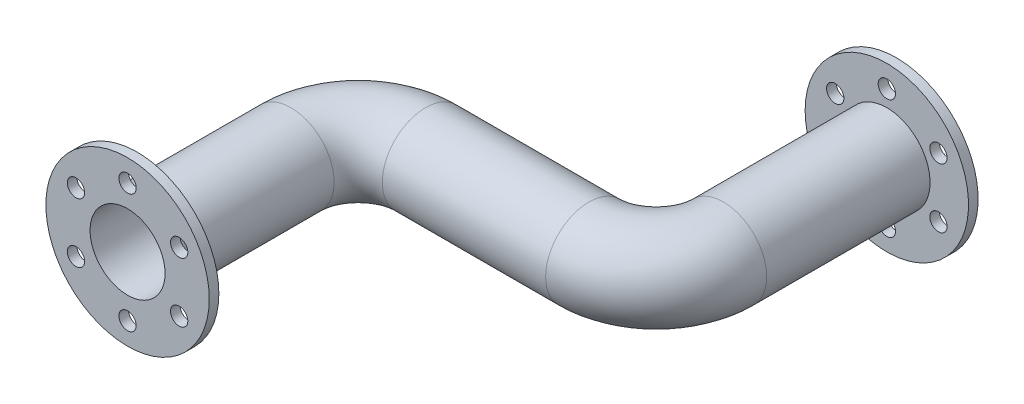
ISO-10303-21;
HEADER;
FILE_DESCRIPTION(('STEP AP214'),'2;1');
FILE_NAME('part.step','',(''),(''),'','','');
FILE_SCHEMA(('AUTOMOTIVE_DESIGN { 1 0 10303 214 1 1 1 1 }'));
ENDSEC;
DATA;
#1=APPLICATION_CONTEXT('core data for automotive mechanical design processes');
#2=APPLICATION_PROTOCOL_DEFINITION('international standard','automotive_design',2000,#1);
#3=PRODUCT_CONTEXT('',#1,'mechanical');
#4=PRODUCT('Part','Part','',(#3));
#5=PRODUCT_RELATED_PRODUCT_CATEGORY('part','',(#4));
#6=PRODUCT_DEFINITION_FORMATION('','',#4);
#7=PRODUCT_DEFINITION_CONTEXT('part definition',#1,'design');
#8=PRODUCT_DEFINITION('design','',#6,#7);
#9=PRODUCT_DEFINITION_SHAPE('','',#8);
#10=(LENGTH_UNIT() NAMED_UNIT(*) SI_UNIT(.MILLI.,.METRE.));
#11=(NAMED_UNIT(*) PLANE_ANGLE_UNIT() SI_UNIT($,.RADIAN.));
#12=(NAMED_UNIT(*) SI_UNIT($,.STERADIAN.) SOLID_ANGLE_UNIT());
#13=UNCERTAINTY_MEASURE_WITH_UNIT(LENGTH_MEASURE(1.E-05),#10,'distance_accuracy_value','');
#14=(GEOMETRIC_REPRESENTATION_CONTEXT(3) GLOBAL_UNCERTAINTY_ASSIGNED_CONTEXT((#13)) GLOBAL_UNIT_ASSIGNED_CONTEXT((#10,
#11,#12)) REPRESENTATION_CONTEXT('',''));
#15=CARTESIAN_POINT('',(0.,0.,0.));
#16=DIRECTION('',(0.,0.,1.));
#17=DIRECTION('',(1.,0.,0.));
#18=AXIS2_PLACEMENT_3D('',#15,#16,#17);
#19=CARTESIAN_POINT('',(0.,0.,-85.));
#20=DIRECTION('',(0.,0.,1.));
#21=DIRECTION('',(1.,0.,0.));
#22=AXIS2_PLACEMENT_3D('',#19,#20,#21);
#23=CYLINDRICAL_SURFACE('',#22,22.5);
#24=CARTESIAN_POINT('',(0.,0.,-85.));
#25=DIRECTION('',(0.,0.,1.));
#26=DIRECTION('',(1.,0.,0.));
#27=AXIS2_PLACEMENT_3D('',#24,#25,#26);
#28=CIRCLE('',#27,22.5);
#29=CARTESIAN_POINT('',(-22.5,0.,-85.));
#30=VERTEX_POINT('',#29);
#31=EDGE_CURVE('E57',#30,#30,#28,.T.);
#32=ORIENTED_EDGE('',*,*,#31,.T.);
#33=EDGE_LOOP('',(#32));
#34=FACE_BOUND('',#33,.T.);
#35=CARTESIAN_POINT('',(0.,0.,-5.));
#36=DIRECTION('',(0.,0.,1.));
#37=DIRECTION('',(1.,0.,0.));
#38=AXIS2_PLACEMENT_3D('',#35,#36,#37);
#39=CIRCLE('',#38,22.5);
#40=CARTESIAN_POINT('',(22.5,0.,-5.));
#41=VERTEX_POINT('',#40);
#42=EDGE_CURVE('E35',#41,#41,#39,.F.);
#43=ORIENTED_EDGE('',*,*,#42,.T.);
#44=EDGE_LOOP('',(#43));
#45=FACE_BOUND('',#44,.T.);
#46=ADVANCED_FACE('F31',(#34,#45),#23,.T.);
#47=CARTESIAN_POINT('',(155.,0.,-155.));
#48=DIRECTION('',(0.,0.,-1.));
#49=DIRECTION('',(-1.,0.,0.));
#50=AXIS2_PLACEMENT_3D('',#47,#48,#49);
#51=CYLINDRICAL_SURFACE('',#50,22.5);
#52=CARTESIAN_POINT('',(155.,0.,-155.));
#53=DIRECTION('',(0.,0.,1.));
#54=DIRECTION('',(1.,0.,0.));
#55=AXIS2_PLACEMENT_3D('',#52,#53,#54);
#56=CIRCLE('',#55,22.5);
#57=CARTESIAN_POINT('',(177.5,0.,-155.));
#58=VERTEX_POINT('',#57);
#59=EDGE_CURVE('E10',#58,#58,#56,.T.);
#60=ORIENTED_EDGE('',*,*,#59,.F.);
#61=EDGE_LOOP('',(#60));
#62=FACE_BOUND('',#61,.T.);
#63=CARTESIAN_POINT('',(155.,0.,-240.));
#64=DIRECTION('',(0.,0.,-1.));
#65=DIRECTION('',(-1.,0.,0.));
#66=AXIS2_PLACEMENT_3D('',#63,#64,#65);
#67=CIRCLE('',#66,22.5);
#68=CARTESIAN_POINT('',(132.5,0.,-240.));
#69=VERTEX_POINT('',#68);
#70=EDGE_CURVE('E108',#69,#69,#67,.T.);
#71=ORIENTED_EDGE('',*,*,#70,.F.);
#72=EDGE_LOOP('',(#71));
#73=FACE_BOUND('',#72,.T.);
#74=ADVANCED_FACE('F33',(#62,#73),#51,.T.);
#75=CARTESIAN_POINT('',(155.,0.,-155.));
#76=DIRECTION('',(0.,0.,-1.));
#77=DIRECTION('',(-1.,0.,0.));
#78=AXIS2_PLACEMENT_3D('',#75,#76,#77);
#79=CYLINDRICAL_SURFACE('',#78,19.5);
#80=CARTESIAN_POINT('',(155.,0.,-155.));
#81=DIRECTION('',(0.,0.,1.));
#82=DIRECTION('',(1.,0.,0.));
#83=AXIS2_PLACEMENT_3D('',#80,#81,#82);
#84=CIRCLE('',#83,19.5);
#85=CARTESIAN_POINT('',(174.5,0.,-155.));
#86=VERTEX_POINT('',#85);
#87=EDGE_CURVE('E39',#86,#86,#84,.T.);
#88=ORIENTED_EDGE('',*,*,#87,.T.);
#89=EDGE_LOOP('',(#88));
#90=FACE_BOUND('',#89,.T.);
#91=CARTESIAN_POINT('',(155.,0.,-245.));
#92=DIRECTION('',(0.,0.,-1.));
#93=DIRECTION('',(-1.,0.,0.));
#94=AXIS2_PLACEMENT_3D('',#91,#92,#93);
#95=CIRCLE('',#94,19.5);
#96=CARTESIAN_POINT('',(135.5,0.,-245.));
#97=VERTEX_POINT('',#96);
#98=EDGE_CURVE('E117',#97,#97,#95,.T.);
#99=ORIENTED_EDGE('',*,*,#98,.T.);
#100=EDGE_LOOP('',(#99));
#101=FACE_BOUND('',#100,.T.);
#102=ADVANCED_FACE('F180',(#90,#101),#79,.F.);
#103=CARTESIAN_POINT('',(120.,0.,-155.));
#104=DIRECTION('',(0.,1.,0.));
#105=DIRECTION('',(0.,0.,1.));
#106=AXIS2_PLACEMENT_3D('',#103,#104,#105);
#107=TOROIDAL_SURFACE('',#106,35.,22.5);
#108=CARTESIAN_POINT('',(120.,0.,-120.));
#109=DIRECTION('',(-1.,0.,0.));
#110=DIRECTION('',(0.,0.,1.));
#111=AXIS2_PLACEMENT_3D('',#108,#109,#110);
#112=CIRCLE('',#111,22.5);
#113=CARTESIAN_POINT('',(120.,0.,-97.5));
#114=VERTEX_POINT('',#113);
#115=EDGE_CURVE('E43',#114,#114,#112,.T.);
#116=CARTESIAN_POINT('',(120.,0.,-155.));
#117=DIRECTION('',(0.,1.,0.));
#118=DIRECTION('',(0.,0.,1.));
#119=AXIS2_PLACEMENT_3D('',#116,#117,#118);
#120=CIRCLE('',#119,57.5);
#121=EDGE_CURVE('',#114,#58,#120,.T.);
#122=ORIENTED_EDGE('',*,*,#115,.F.);
#123=ORIENTED_EDGE('',*,*,#59,.T.);
#124=ORIENTED_EDGE('',*,*,#121,.T.);
#125=ORIENTED_EDGE('',*,*,#121,.F.);
#126=EDGE_LOOP('',(#122,#124,#123,#125));
#127=FACE_BOUND('',#126,.T.);
#128=ADVANCED_FACE('F182',(#127),#107,.T.);
#129=CARTESIAN_POINT('',(120.,0.,-155.));
#130=DIRECTION('',(0.,1.,0.));
#131=DIRECTION('',(0.,0.,1.));
#132=AXIS2_PLACEMENT_3D('',#129,#130,#131);
#133=TOROIDAL_SURFACE('',#132,35.,19.5);
#134=CARTESIAN_POINT('',(120.,0.,-120.));
#135=DIRECTION('',(-1.,0.,0.));
#136=DIRECTION('',(0.,0.,1.));
#137=AXIS2_PLACEMENT_3D('',#134,#135,#136);
#138=CIRCLE('',#137,19.5);
#139=CARTESIAN_POINT('',(120.,0.,-100.5));
#140=VERTEX_POINT('',#139);
#141=EDGE_CURVE('E48',#140,#140,#138,.T.);
#142=CARTESIAN_POINT('',(120.,0.,-155.));
#143=DIRECTION('',(0.,1.,0.));
#144=DIRECTION('',(0.,0.,1.));
#145=AXIS2_PLACEMENT_3D('',#142,#143,#144);
#146=CIRCLE('',#145,54.5);
#147=EDGE_CURVE('',#140,#86,#146,.T.);
#148=ORIENTED_EDGE('',*,*,#141,.T.);
#149=ORIENTED_EDGE('',*,*,#87,.F.);
#150=ORIENTED_EDGE('',*,*,#147,.T.);
#151=ORIENTED_EDGE('',*,*,#147,.F.);
#152=EDGE_LOOP('',(#148,#150,#149,#151));
#153=FACE_BOUND('',#152,.T.);
#154=ADVANCED_FACE('F188',(#153),#133,.F.);
#155=CARTESIAN_POINT('',(35.,0.,-120.));
#156=DIRECTION('',(1.,0.,0.));
#157=DIRECTION('',(0.,0.,-1.));
#158=AXIS2_PLACEMENT_3D('',#155,#156,#157);
#159=CYLINDRICAL_SURFACE('',#158,22.5);
#160=CARTESIAN_POINT('',(35.,0.,-120.));
#161=DIRECTION('',(-1.,0.,0.));
#162=DIRECTION('',(0.,0.,1.));
#163=AXIS2_PLACEMENT_3D('',#160,#161,#162);
#164=CIRCLE('',#163,22.5);
#165=CARTESIAN_POINT('',(35.,0.,-142.5));
#166=VERTEX_POINT('',#165);
#167=EDGE_CURVE('E51',#166,#166,#164,.T.);
#168=ORIENTED_EDGE('',*,*,#167,.F.);
#169=EDGE_LOOP('',(#168));
#170=FACE_BOUND('',#169,.T.);
#171=ORIENTED_EDGE('',*,*,#115,.T.);
#172=EDGE_LOOP('',(#171));
#173=FACE_BOUND('',#172,.T.);
#174=ADVANCED_FACE('F217',(#170,#173),#159,.T.);
#175=CARTESIAN_POINT('',(35.,0.,-120.));
#176=DIRECTION('',(1.,0.,0.));
#177=DIRECTION('',(0.,0.,-1.));
#178=AXIS2_PLACEMENT_3D('',#175,#176,#177);
#179=CYLINDRICAL_SURFACE('',#178,19.5);
#180=CARTESIAN_POINT('',(35.,0.,-120.));
#181=DIRECTION('',(-1.,0.,0.));
#182=DIRECTION('',(0.,0.,1.));
#183=AXIS2_PLACEMENT_3D('',#180,#181,#182);
#184=CIRCLE('',#183,19.5);
#185=CARTESIAN_POINT('',(35.,0.,-139.5));
#186=VERTEX_POINT('',#185);
#187=EDGE_CURVE('E54',#186,#186,#184,.T.);
#188=ORIENTED_EDGE('',*,*,#187,.T.);
#189=EDGE_LOOP('',(#188));
#190=FACE_BOUND('',#189,.T.);
#191=ORIENTED_EDGE('',*,*,#141,.F.);
#192=EDGE_LOOP('',(#191));
#193=FACE_BOUND('',#192,.T.);
#194=ADVANCED_FACE('F213',(#190,#193),#179,.F.);
#195=CARTESIAN_POINT('',(35.,0.,-85.));
#196=DIRECTION('',(0.,-1.,0.));
#197=DIRECTION('',(0.,0.,-1.));
#198=AXIS2_PLACEMENT_3D('',#195,#196,#197);
#199=TOROIDAL_SURFACE('',#198,35.,22.5);
#200=CARTESIAN_POINT('',(35.,0.,-85.));
#201=DIRECTION('',(0.,-1.,0.));
#202=DIRECTION('',(0.,0.,-1.));
#203=AXIS2_PLACEMENT_3D('',#200,#201,#202);
#204=CIRCLE('',#203,57.5);
#205=EDGE_CURVE('',#30,#166,#204,.T.);
#206=ORIENTED_EDGE('',*,*,#31,.F.);
#207=ORIENTED_EDGE('',*,*,#167,.T.);
#208=ORIENTED_EDGE('',*,*,#205,.T.);
#209=ORIENTED_EDGE('',*,*,#205,.F.);
#210=EDGE_LOOP('',(#206,#208,#207,#209));
#211=FACE_BOUND('',#210,.T.);
#212=ADVANCED_FACE('F209',(#211),#199,.T.);
#213=CARTESIAN_POINT('',(35.,0.,-85.));
#214=DIRECTION('',(0.,-1.,0.));
#215=DIRECTION('',(0.,0.,-1.));
#216=AXIS2_PLACEMENT_3D('',#213,#214,#215);
#217=TOROIDAL_SURFACE('',#216,35.,19.5);
#218=CARTESIAN_POINT('',(0.,0.,-85.));
#219=DIRECTION('',(0.,0.,1.));
#220=DIRECTION('',(1.,0.,0.));
#221=AXIS2_PLACEMENT_3D('',#218,#219,#220);
#222=CIRCLE('',#221,19.5);
#223=CARTESIAN_POINT('',(-19.5,0.,-85.));
#224=VERTEX_POINT('',#223);
#225=EDGE_CURVE('E60',#224,#224,#222,.T.);
#226=CARTESIAN_POINT('',(35.,0.,-85.));
#227=DIRECTION('',(0.,-1.,0.));
#228=DIRECTION('',(0.,0.,-1.));
#229=AXIS2_PLACEMENT_3D('',#226,#227,#228);
#230=CIRCLE('',#229,54.5);
#231=EDGE_CURVE('',#224,#186,#230,.T.);
#232=ORIENTED_EDGE('',*,*,#225,.T.);
#233=ORIENTED_EDGE('',*,*,#187,.F.);
#234=ORIENTED_EDGE('',*,*,#231,.T.);
#235=ORIENTED_EDGE('',*,*,#231,.F.);
#236=EDGE_LOOP('',(#232,#234,#233,#235));
#237=FACE_BOUND('',#236,.T.);
#238=ADVANCED_FACE('F205',(#237),#217,.F.);
#239=CARTESIAN_POINT('',(0.,0.,-85.));
#240=DIRECTION('',(0.,0.,1.));
#241=DIRECTION('',(1.,0.,0.));
#242=AXIS2_PLACEMENT_3D('',#239,#240,#241);
#243=CYLINDRICAL_SURFACE('',#242,19.5);
#244=CARTESIAN_POINT('',(0.,0.,0.));
#245=DIRECTION('',(0.,0.,1.));
#246=DIRECTION('',(1.,0.,0.));
#247=AXIS2_PLACEMENT_3D('',#244,#245,#246);
#248=CIRCLE('',#247,19.5);
#249=CARTESIAN_POINT('',(19.5,0.,0.));
#250=VERTEX_POINT('',#249);
#251=EDGE_CURVE('E63',#250,#250,#248,.T.);
#252=ORIENTED_EDGE('',*,*,#251,.T.);
#253=EDGE_LOOP('',(#252));
#254=FACE_BOUND('',#253,.T.);
#255=ORIENTED_EDGE('',*,*,#225,.F.);
#256=EDGE_LOOP('',(#255));
#257=FACE_BOUND('',#256,.T.);
#258=ADVANCED_FACE('F202',(#254,#257),#243,.F.);
#259=CARTESIAN_POINT('',(0.,0.,0.));
#260=DIRECTION('',(0.,0.,1.));
#261=DIRECTION('',(1.,0.,0.));
#262=AXIS2_PLACEMENT_3D('',#259,#260,#261);
#263=PLANE('',#262);
#264=CARTESIAN_POINT('',(-26.8467875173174,-15.5000000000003,0.));
#265=DIRECTION('',(0.,0.,1.));
#266=DIRECTION('',(0.50000000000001,-0.866025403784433,0.));
#267=AXIS2_PLACEMENT_3D('',#264,#265,#266);
#268=CIRCLE('',#267,4.5);
#269=CARTESIAN_POINT('',(-24.5967875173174,-19.3971143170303,0.));
#270=VERTEX_POINT('',#269);
#271=EDGE_CURVE('E102',#270,#270,#268,.T.);
#272=ORIENTED_EDGE('',*,*,#271,.F.);
#273=EDGE_LOOP('',(#272));
#274=FACE_BOUND('',#273,.T.);
#275=CARTESIAN_POINT('',(-26.8467875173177,15.4999999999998,0.));
#276=DIRECTION('',(0.,0.,1.));
#277=DIRECTION('',(-0.499999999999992,-0.866025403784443,0.));
#278=AXIS2_PLACEMENT_3D('',#275,#276,#277);
#279=CIRCLE('',#278,4.5);
#280=CARTESIAN_POINT('',(-29.0967875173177,11.6028856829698,0.));
#281=VERTEX_POINT('',#280);
#282=EDGE_CURVE('E96',#281,#281,#279,.T.);
#283=ORIENTED_EDGE('',*,*,#282,.F.);
#284=EDGE_LOOP('',(#283));
#285=FACE_BOUND('',#284,.T.);
#286=CARTESIAN_POINT('',(-2.16471968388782E-13,31.,0.));
#287=DIRECTION('',(0.,0.,1.));
#288=DIRECTION('',(-1.,0.,0.));
#289=AXIS2_PLACEMENT_3D('',#286,#287,#288);
#290=CIRCLE('',#289,4.5);
#291=CARTESIAN_POINT('',(-4.50000000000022,31.,0.));
#292=VERTEX_POINT('',#291);
#293=EDGE_CURVE('E90',#292,#292,#290,.T.);
#294=ORIENTED_EDGE('',*,*,#293,.F.);
#295=EDGE_LOOP('',(#294));
#296=FACE_BOUND('',#295,.T.);
#297=CARTESIAN_POINT('',(26.8467875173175,15.5000000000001,0.));
#298=DIRECTION('',(0.,0.,1.));
#299=DIRECTION('',(-0.500000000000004,0.866025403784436,0.));
#300=AXIS2_PLACEMENT_3D('',#297,#298,#299);
#301=CIRCLE('',#300,4.5);
#302=CARTESIAN_POINT('',(24.5967875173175,19.3971143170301,0.));
#303=VERTEX_POINT('',#302);
#304=EDGE_CURVE('E84',#303,#303,#301,.T.);
#305=ORIENTED_EDGE('',*,*,#304,.F.);
#306=EDGE_LOOP('',(#305));
#307=FACE_BOUND('',#306,.T.);
#308=CARTESIAN_POINT('',(26.8467875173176,-15.4999999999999,0.));
#309=DIRECTION('',(0.,0.,1.));
#310=DIRECTION('',(0.499999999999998,0.86602540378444,0.));
#311=AXIS2_PLACEMENT_3D('',#308,#309,#310);
#312=CIRCLE('',#311,4.5);
#313=CARTESIAN_POINT('',(29.0967875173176,-11.60288568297,0.));
#314=VERTEX_POINT('',#313);
#315=EDGE_CURVE('E78',#314,#314,#312,.T.);
#316=ORIENTED_EDGE('',*,*,#315,.F.);
#317=EDGE_LOOP('',(#316));
#318=FACE_BOUND('',#317,.T.);
#319=CARTESIAN_POINT('',(0.,-31.,0.));
#320=DIRECTION('',(0.,0.,1.));
#321=DIRECTION('',(1.,0.,0.));
#322=AXIS2_PLACEMENT_3D('',#319,#320,#321);
#323=CIRCLE('',#322,4.5);
#324=CARTESIAN_POINT('',(4.5,-31.,0.));
#325=VERTEX_POINT('',#324);
#326=EDGE_CURVE('E75',#325,#325,#323,.T.);
#327=ORIENTED_EDGE('',*,*,#326,.F.);
#328=EDGE_LOOP('',(#327));
#329=FACE_BOUND('',#328,.T.);
#330=ORIENTED_EDGE('',*,*,#251,.F.);
#331=EDGE_LOOP('',(#330));
#332=FACE_BOUND('',#331,.T.);
#333=CARTESIAN_POINT('',(0.,0.,0.));
#334=DIRECTION('',(0.,0.,1.));
#335=DIRECTION('',(1.,0.,0.));
#336=AXIS2_PLACEMENT_3D('',#333,#334,#335);
#337=CIRCLE('',#336,42.5);
#338=CARTESIAN_POINT('',(42.5,0.,0.));
#339=VERTEX_POINT('',#338);
#340=EDGE_CURVE('E69',#339,#339,#337,.T.);
#341=ORIENTED_EDGE('',*,*,#340,.T.);
#342=EDGE_LOOP('',(#341));
#343=FACE_BOUND('',#342,.T.);
#344=ADVANCED_FACE('F200',(#274,#285,#296,#307,#318,#329,#332,#343),#263,.T.);
#345=CARTESIAN_POINT('',(0.,0.,-5.));
#346=DIRECTION('',(0.,0.,1.));
#347=DIRECTION('',(1.,0.,0.));
#348=AXIS2_PLACEMENT_3D('',#345,#346,#347);
#349=CYLINDRICAL_SURFACE('',#348,42.5);
#350=CARTESIAN_POINT('',(0.,0.,-5.));
#351=DIRECTION('',(0.,0.,1.));
#352=DIRECTION('',(1.,0.,0.));
#353=AXIS2_PLACEMENT_3D('',#350,#351,#352);
#354=CIRCLE('',#353,42.5);
#355=CARTESIAN_POINT('',(42.5,0.,-5.));
#356=VERTEX_POINT('',#355);
#357=EDGE_CURVE('E66',#356,#356,#354,.T.);
#358=ORIENTED_EDGE('',*,*,#357,.T.);
#359=EDGE_LOOP('',(#358));
#360=FACE_BOUND('',#359,.T.);
#361=ORIENTED_EDGE('',*,*,#340,.F.);
#362=EDGE_LOOP('',(#361));
#363=FACE_BOUND('',#362,.T.);
#364=ADVANCED_FACE('F259',(#360,#363),#349,.T.);
#365=CARTESIAN_POINT('',(0.,0.,-5.));
#366=DIRECTION('',(0.,0.,1.));
#367=DIRECTION('',(1.,0.,0.));
#368=AXIS2_PLACEMENT_3D('',#365,#366,#367);
#369=PLANE('',#368);
#370=CARTESIAN_POINT('',(-26.8467875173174,-15.5000000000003,-5.));
#371=DIRECTION('',(0.,0.,1.));
#372=DIRECTION('',(0.50000000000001,-0.866025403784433,0.));
#373=AXIS2_PLACEMENT_3D('',#370,#371,#372);
#374=CIRCLE('',#373,4.5);
#375=CARTESIAN_POINT('',(-24.5967875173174,-19.3971143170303,-5.));
#376=VERTEX_POINT('',#375);
#377=EDGE_CURVE('E105',#376,#376,#374,.T.);
#378=ORIENTED_EDGE('',*,*,#377,.T.);
#379=EDGE_LOOP('',(#378));
#380=FACE_BOUND('',#379,.T.);
#381=CARTESIAN_POINT('',(-26.8467875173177,15.4999999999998,-5.));
#382=DIRECTION('',(0.,0.,1.));
#383=DIRECTION('',(-0.499999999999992,-0.866025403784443,0.));
#384=AXIS2_PLACEMENT_3D('',#381,#382,#383);
#385=CIRCLE('',#384,4.5);
#386=CARTESIAN_POINT('',(-29.0967875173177,11.6028856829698,-5.));
#387=VERTEX_POINT('',#386);
#388=EDGE_CURVE('E99',#387,#387,#385,.T.);
#389=ORIENTED_EDGE('',*,*,#388,.T.);
#390=EDGE_LOOP('',(#389));
#391=FACE_BOUND('',#390,.T.);
#392=CARTESIAN_POINT('',(-2.16471968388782E-13,31.,-5.));
#393=DIRECTION('',(0.,0.,1.));
#394=DIRECTION('',(-1.,0.,0.));
#395=AXIS2_PLACEMENT_3D('',#392,#393,#394);
#396=CIRCLE('',#395,4.5);
#397=CARTESIAN_POINT('',(-4.50000000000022,31.,-5.));
#398=VERTEX_POINT('',#397);
#399=EDGE_CURVE('E93',#398,#398,#396,.T.);
#400=ORIENTED_EDGE('',*,*,#399,.T.);
#401=EDGE_LOOP('',(#400));
#402=FACE_BOUND('',#401,.T.);
#403=CARTESIAN_POINT('',(26.8467875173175,15.5000000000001,-5.));
#404=DIRECTION('',(0.,0.,1.));
#405=DIRECTION('',(-0.500000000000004,0.866025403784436,0.));
#406=AXIS2_PLACEMENT_3D('',#403,#404,#405);
#407=CIRCLE('',#406,4.5);
#408=CARTESIAN_POINT('',(24.5967875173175,19.3971143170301,-5.));
#409=VERTEX_POINT('',#408);
#410=EDGE_CURVE('E87',#409,#409,#407,.T.);
#411=ORIENTED_EDGE('',*,*,#410,.T.);
#412=EDGE_LOOP('',(#411));
#413=FACE_BOUND('',#412,.T.);
#414=CARTESIAN_POINT('',(26.8467875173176,-15.4999999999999,-5.));
#415=DIRECTION('',(0.,0.,1.));
#416=DIRECTION('',(0.499999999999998,0.86602540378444,0.));
#417=AXIS2_PLACEMENT_3D('',#414,#415,#416);
#418=CIRCLE('',#417,4.5);
#419=CARTESIAN_POINT('',(29.0967875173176,-11.60288568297,-5.));
#420=VERTEX_POINT('',#419);
#421=EDGE_CURVE('E81',#420,#420,#418,.T.);
#422=ORIENTED_EDGE('',*,*,#421,.T.);
#423=EDGE_LOOP('',(#422));
#424=FACE_BOUND('',#423,.T.);
#425=CARTESIAN_POINT('',(0.,-31.,-5.));
#426=DIRECTION('',(0.,0.,1.));
#427=DIRECTION('',(1.,0.,0.));
#428=AXIS2_PLACEMENT_3D('',#425,#426,#427);
#429=CIRCLE('',#428,4.5);
#430=CARTESIAN_POINT('',(4.5,-31.,-5.));
#431=VERTEX_POINT('',#430);
#432=EDGE_CURVE('E72',#431,#431,#429,.T.);
#433=ORIENTED_EDGE('',*,*,#432,.T.);
#434=EDGE_LOOP('',(#433));
#435=FACE_BOUND('',#434,.T.);
#436=ORIENTED_EDGE('',*,*,#42,.F.);
#437=EDGE_LOOP('',(#436));
#438=FACE_BOUND('',#437,.T.);
#439=ORIENTED_EDGE('',*,*,#357,.F.);
#440=EDGE_LOOP('',(#439));
#441=FACE_BOUND('',#440,.T.);
#442=ADVANCED_FACE('F267',(#380,#391,#402,#413,#424,#435,#438,#441),#369,.F.);
#443=CARTESIAN_POINT('',(0.,-31.,0.));
#444=DIRECTION('',(0.,0.,1.));
#445=DIRECTION('',(1.,0.,0.));
#446=AXIS2_PLACEMENT_3D('',#443,#444,#445);
#447=CYLINDRICAL_SURFACE('',#446,4.5);
#448=ORIENTED_EDGE('',*,*,#432,.F.);
#449=EDGE_LOOP('',(#448));
#450=FACE_BOUND('',#449,.T.);
#451=ORIENTED_EDGE('',*,*,#326,.T.);
#452=EDGE_LOOP('',(#451));
#453=FACE_BOUND('',#452,.T.);
#454=ADVANCED_FACE('F273',(#450,#453),#447,.F.);
#455=CARTESIAN_POINT('',(26.8467875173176,-15.4999999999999,0.));
#456=DIRECTION('',(0.,0.,1.));
#457=DIRECTION('',(0.499999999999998,0.86602540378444,0.));
#458=AXIS2_PLACEMENT_3D('',#455,#456,#457);
#459=CYLINDRICAL_SURFACE('',#458,4.5);
#460=ORIENTED_EDGE('',*,*,#421,.F.);
#461=EDGE_LOOP('',(#460));
#462=FACE_BOUND('',#461,.T.);
#463=ORIENTED_EDGE('',*,*,#315,.T.);
#464=EDGE_LOOP('',(#463));
#465=FACE_BOUND('',#464,.T.);
#466=ADVANCED_FACE('F281',(#462,#465),#459,.F.);
#467=CARTESIAN_POINT('',(26.8467875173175,15.5000000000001,0.));
#468=DIRECTION('',(0.,0.,1.));
#469=DIRECTION('',(-0.500000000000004,0.866025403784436,0.));
#470=AXIS2_PLACEMENT_3D('',#467,#468,#469);
#471=CYLINDRICAL_SURFACE('',#470,4.5);
#472=ORIENTED_EDGE('',*,*,#410,.F.);
#473=EDGE_LOOP('',(#472));
#474=FACE_BOUND('',#473,.T.);
#475=ORIENTED_EDGE('',*,*,#304,.T.);
#476=EDGE_LOOP('',(#475));
#477=FACE_BOUND('',#476,.T.);
#478=ADVANCED_FACE('F288',(#474,#477),#471,.F.);
#479=CARTESIAN_POINT('',(-2.16471968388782E-13,31.,0.));
#480=DIRECTION('',(0.,0.,1.));
#481=DIRECTION('',(-1.,0.,0.));
#482=AXIS2_PLACEMENT_3D('',#479,#480,#481);
#483=CYLINDRICAL_SURFACE('',#482,4.5);
#484=ORIENTED_EDGE('',*,*,#399,.F.);
#485=EDGE_LOOP('',(#484));
#486=FACE_BOUND('',#485,.T.);
#487=ORIENTED_EDGE('',*,*,#293,.T.);
#488=EDGE_LOOP('',(#487));
#489=FACE_BOUND('',#488,.T.);
#490=ADVANCED_FACE('F296',(#486,#489),#483,.F.);
#491=CARTESIAN_POINT('',(-26.8467875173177,15.4999999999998,0.));
#492=DIRECTION('',(0.,0.,1.));
#493=DIRECTION('',(-0.499999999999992,-0.866025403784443,0.));
#494=AXIS2_PLACEMENT_3D('',#491,#492,#493);
#495=CYLINDRICAL_SURFACE('',#494,4.5);
#496=ORIENTED_EDGE('',*,*,#388,.F.);
#497=EDGE_LOOP('',(#496));
#498=FACE_BOUND('',#497,.T.);
#499=ORIENTED_EDGE('',*,*,#282,.T.);
#500=EDGE_LOOP('',(#499));
#501=FACE_BOUND('',#500,.T.);
#502=ADVANCED_FACE('F304',(#498,#501),#495,.F.);
#503=CARTESIAN_POINT('',(-26.8467875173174,-15.5000000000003,0.));
#504=DIRECTION('',(0.,0.,1.));
#505=DIRECTION('',(0.50000000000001,-0.866025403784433,0.));
#506=AXIS2_PLACEMENT_3D('',#503,#504,#505);
#507=CYLINDRICAL_SURFACE('',#506,4.5);
#508=ORIENTED_EDGE('',*,*,#377,.F.);
#509=EDGE_LOOP('',(#508));
#510=FACE_BOUND('',#509,.T.);
#511=ORIENTED_EDGE('',*,*,#271,.T.);
#512=EDGE_LOOP('',(#511));
#513=FACE_BOUND('',#512,.T.);
#514=ADVANCED_FACE('F312',(#510,#513),#507,.F.);
#515=CARTESIAN_POINT('',(155.,0.,-240.));
#516=DIRECTION('',(0.,0.,-1.));
#517=DIRECTION('',(-1.,0.,0.));
#518=AXIS2_PLACEMENT_3D('',#515,#516,#517);
#519=PLANE('',#518);
#520=CARTESIAN_POINT('',(128.153212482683,15.5000000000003,-240.));
#521=DIRECTION('',(0.,0.,-1.));
#522=DIRECTION('',(-0.50000000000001,-0.866025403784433,0.));
#523=AXIS2_PLACEMENT_3D('',#520,#521,#522);
#524=CIRCLE('',#523,4.5);
#525=CARTESIAN_POINT('',(125.903212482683,11.6028856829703,-240.));
#526=VERTEX_POINT('',#525);
#527=EDGE_CURVE('E150',#526,#526,#524,.T.);
#528=ORIENTED_EDGE('',*,*,#527,.T.);
#529=EDGE_LOOP('',(#528));
#530=FACE_BOUND('',#529,.T.);
#531=CARTESIAN_POINT('',(128.153212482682,-15.4999999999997,-240.));
#532=DIRECTION('',(0.,0.,-1.));
#533=DIRECTION('',(0.499999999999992,-0.866025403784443,0.));
#534=AXIS2_PLACEMENT_3D('',#531,#532,#533);
#535=CIRCLE('',#534,4.5);
#536=CARTESIAN_POINT('',(130.403212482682,-19.3971143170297,-240.));
#537=VERTEX_POINT('',#536);
#538=EDGE_CURVE('E144',#537,#537,#535,.T.);
#539=ORIENTED_EDGE('',*,*,#538,.T.);
#540=EDGE_LOOP('',(#539));
#541=FACE_BOUND('',#540,.T.);
#542=CARTESIAN_POINT('',(155.,-31.,-240.));
#543=DIRECTION('',(0.,0.,-1.));
#544=DIRECTION('',(1.,0.,0.));
#545=AXIS2_PLACEMENT_3D('',#542,#543,#544);
#546=CIRCLE('',#545,4.5);
#547=CARTESIAN_POINT('',(159.5,-31.,-240.));
#548=VERTEX_POINT('',#547);
#549=EDGE_CURVE('E138',#548,#548,#546,.T.);
#550=ORIENTED_EDGE('',*,*,#549,.T.);
#551=EDGE_LOOP('',(#550));
#552=FACE_BOUND('',#551,.T.);
#553=CARTESIAN_POINT('',(181.846787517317,-15.5000000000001,-240.));
#554=DIRECTION('',(0.,0.,-1.));
#555=DIRECTION('',(0.500000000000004,0.866025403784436,0.));
#556=AXIS2_PLACEMENT_3D('',#553,#554,#555);
#557=CIRCLE('',#556,4.5);
#558=CARTESIAN_POINT('',(184.096787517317,-11.6028856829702,-240.));
#559=VERTEX_POINT('',#558);
#560=EDGE_CURVE('E132',#559,#559,#557,.T.);
#561=ORIENTED_EDGE('',*,*,#560,.T.);
#562=EDGE_LOOP('',(#561));
#563=FACE_BOUND('',#562,.T.);
#564=CARTESIAN_POINT('',(181.846787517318,15.4999999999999,-240.));
#565=DIRECTION('',(0.,0.,-1.));
#566=DIRECTION('',(-0.499999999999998,0.86602540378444,0.));
#567=AXIS2_PLACEMENT_3D('',#564,#565,#566);
#568=CIRCLE('',#567,4.5);
#569=CARTESIAN_POINT('',(179.596787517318,19.3971143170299,-240.));
#570=VERTEX_POINT('',#569);
#571=EDGE_CURVE('E126',#570,#570,#568,.T.);
#572=ORIENTED_EDGE('',*,*,#571,.T.);
#573=EDGE_LOOP('',(#572));
#574=FACE_BOUND('',#573,.T.);
#575=CARTESIAN_POINT('',(155.,31.,-240.));
#576=DIRECTION('',(0.,0.,-1.));
#577=DIRECTION('',(-1.,0.,0.));
#578=AXIS2_PLACEMENT_3D('',#575,#576,#577);
#579=CIRCLE('',#578,4.5);
#580=CARTESIAN_POINT('',(150.5,31.,-240.));
#581=VERTEX_POINT('',#580);
#582=EDGE_CURVE('E120',#581,#581,#579,.T.);
#583=ORIENTED_EDGE('',*,*,#582,.T.);
#584=EDGE_LOOP('',(#583));
#585=FACE_BOUND('',#584,.T.);
#586=CARTESIAN_POINT('',(155.,0.,-240.));
#587=DIRECTION('',(0.,0.,-1.));
#588=DIRECTION('',(-1.,0.,0.));
#589=AXIS2_PLACEMENT_3D('',#586,#587,#588);
#590=CIRCLE('',#589,42.5);
#591=CARTESIAN_POINT('',(112.5,0.,-240.));
#592=VERTEX_POINT('',#591);
#593=EDGE_CURVE('E114',#592,#592,#590,.T.);
#594=ORIENTED_EDGE('',*,*,#593,.F.);
#595=EDGE_LOOP('',(#594));
#596=FACE_BOUND('',#595,.T.);
#597=ORIENTED_EDGE('',*,*,#70,.T.);
#598=EDGE_LOOP('',(#597));
#599=FACE_BOUND('',#598,.T.);
#600=ADVANCED_FACE('F164',(#530,#541,#552,#563,#574,#585,#596,#599),#519,.F.);
#601=CARTESIAN_POINT('',(155.,0.,-245.));
#602=DIRECTION('',(0.,0.,-1.));
#603=DIRECTION('',(-1.,0.,0.));
#604=AXIS2_PLACEMENT_3D('',#601,#602,#603);
#605=PLANE('',#604);
#606=CARTESIAN_POINT('',(128.153212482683,15.5000000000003,-245.));
#607=DIRECTION('',(0.,0.,-1.));
#608=DIRECTION('',(-0.50000000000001,-0.866025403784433,0.));
#609=AXIS2_PLACEMENT_3D('',#606,#607,#608);
#610=CIRCLE('',#609,4.5);
#611=CARTESIAN_POINT('',(125.903212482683,11.6028856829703,-245.));
#612=VERTEX_POINT('',#611);
#613=EDGE_CURVE('E153',#612,#612,#610,.T.);
#614=ORIENTED_EDGE('',*,*,#613,.F.);
#615=EDGE_LOOP('',(#614));
#616=FACE_BOUND('',#615,.T.);
#617=CARTESIAN_POINT('',(128.153212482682,-15.4999999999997,-245.));
#618=DIRECTION('',(0.,0.,-1.));
#619=DIRECTION('',(0.499999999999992,-0.866025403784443,0.));
#620=AXIS2_PLACEMENT_3D('',#617,#618,#619);
#621=CIRCLE('',#620,4.5);
#622=CARTESIAN_POINT('',(130.403212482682,-19.3971143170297,-245.));
#623=VERTEX_POINT('',#622);
#624=EDGE_CURVE('E147',#623,#623,#621,.T.);
#625=ORIENTED_EDGE('',*,*,#624,.F.);
#626=EDGE_LOOP('',(#625));
#627=FACE_BOUND('',#626,.T.);
#628=CARTESIAN_POINT('',(155.,-31.,-245.));
#629=DIRECTION('',(0.,0.,-1.));
#630=DIRECTION('',(1.,0.,0.));
#631=AXIS2_PLACEMENT_3D('',#628,#629,#630);
#632=CIRCLE('',#631,4.5);
#633=CARTESIAN_POINT('',(159.5,-31.,-245.));
#634=VERTEX_POINT('',#633);
#635=EDGE_CURVE('E141',#634,#634,#632,.T.);
#636=ORIENTED_EDGE('',*,*,#635,.F.);
#637=EDGE_LOOP('',(#636));
#638=FACE_BOUND('',#637,.T.);
#639=CARTESIAN_POINT('',(181.846787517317,-15.5000000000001,-245.));
#640=DIRECTION('',(0.,0.,-1.));
#641=DIRECTION('',(0.500000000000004,0.866025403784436,0.));
#642=AXIS2_PLACEMENT_3D('',#639,#640,#641);
#643=CIRCLE('',#642,4.5);
#644=CARTESIAN_POINT('',(184.096787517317,-11.6028856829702,-245.));
#645=VERTEX_POINT('',#644);
#646=EDGE_CURVE('E135',#645,#645,#643,.T.);
#647=ORIENTED_EDGE('',*,*,#646,.F.);
#648=EDGE_LOOP('',(#647));
#649=FACE_BOUND('',#648,.T.);
#650=CARTESIAN_POINT('',(181.846787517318,15.4999999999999,-245.));
#651=DIRECTION('',(0.,0.,-1.));
#652=DIRECTION('',(-0.499999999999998,0.86602540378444,0.));
#653=AXIS2_PLACEMENT_3D('',#650,#651,#652);
#654=CIRCLE('',#653,4.5);
#655=CARTESIAN_POINT('',(179.596787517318,19.3971143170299,-245.));
#656=VERTEX_POINT('',#655);
#657=EDGE_CURVE('E129',#656,#656,#654,.T.);
#658=ORIENTED_EDGE('',*,*,#657,.F.);
#659=EDGE_LOOP('',(#658));
#660=FACE_BOUND('',#659,.T.);
#661=CARTESIAN_POINT('',(155.,31.,-245.));
#662=DIRECTION('',(0.,0.,-1.));
#663=DIRECTION('',(-1.,0.,0.));
#664=AXIS2_PLACEMENT_3D('',#661,#662,#663);
#665=CIRCLE('',#664,4.5);
#666=CARTESIAN_POINT('',(150.5,31.,-245.));
#667=VERTEX_POINT('',#666);
#668=EDGE_CURVE('E123',#667,#667,#665,.T.);
#669=ORIENTED_EDGE('',*,*,#668,.F.);
#670=EDGE_LOOP('',(#669));
#671=FACE_BOUND('',#670,.T.);
#672=CARTESIAN_POINT('',(155.,0.,-245.));
#673=DIRECTION('',(0.,0.,-1.));
#674=DIRECTION('',(-1.,0.,0.));
#675=AXIS2_PLACEMENT_3D('',#672,#673,#674);
#676=CIRCLE('',#675,42.5);
#677=CARTESIAN_POINT('',(112.5,0.,-245.));
#678=VERTEX_POINT('',#677);
#679=EDGE_CURVE('E111',#678,#678,#676,.T.);
#680=ORIENTED_EDGE('',*,*,#679,.T.);
#681=EDGE_LOOP('',(#680));
#682=FACE_BOUND('',#681,.T.);
#683=ORIENTED_EDGE('',*,*,#98,.F.);
#684=EDGE_LOOP('',(#683));
#685=FACE_BOUND('',#684,.T.);
#686=ADVANCED_FACE('F160',(#616,#627,#638,#649,#660,#671,#682,#685),#605,.T.);
#687=CARTESIAN_POINT('',(155.,0.,-245.));
#688=DIRECTION('',(0.,0.,1.));
#689=DIRECTION('',(1.,0.,0.));
#690=AXIS2_PLACEMENT_3D('',#687,#688,#689);
#691=CYLINDRICAL_SURFACE('',#690,42.5);
#692=ORIENTED_EDGE('',*,*,#679,.F.);
#693=EDGE_LOOP('',(#692));
#694=FACE_BOUND('',#693,.T.);
#695=ORIENTED_EDGE('',*,*,#593,.T.);
#696=EDGE_LOOP('',(#695));
#697=FACE_BOUND('',#696,.T.);
#698=ADVANCED_FACE('F163',(#694,#697),#691,.T.);
#699=CARTESIAN_POINT('',(155.,31.,-245.));
#700=DIRECTION('',(0.,0.,-1.));
#701=DIRECTION('',(-1.,0.,0.));
#702=AXIS2_PLACEMENT_3D('',#699,#700,#701);
#703=CYLINDRICAL_SURFACE('',#702,4.5);
#704=ORIENTED_EDGE('',*,*,#668,.T.);
#705=EDGE_LOOP('',(#704));
#706=FACE_BOUND('',#705,.T.);
#707=ORIENTED_EDGE('',*,*,#582,.F.);
#708=EDGE_LOOP('',(#707));
#709=FACE_BOUND('',#708,.T.);
#710=ADVANCED_FACE('F340',(#706,#709),#703,.F.);
#711=CARTESIAN_POINT('',(181.846787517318,15.4999999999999,-245.));
#712=DIRECTION('',(0.,0.,-1.));
#713=DIRECTION('',(-0.499999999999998,0.86602540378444,0.));
#714=AXIS2_PLACEMENT_3D('',#711,#712,#713);
#715=CYLINDRICAL_SURFACE('',#714,4.5);
#716=ORIENTED_EDGE('',*,*,#657,.T.);
#717=EDGE_LOOP('',(#716));
#718=FACE_BOUND('',#717,.T.);
#719=ORIENTED_EDGE('',*,*,#571,.F.);
#720=EDGE_LOOP('',(#719));
#721=FACE_BOUND('',#720,.T.);
#722=ADVANCED_FACE('F347',(#718,#721),#715,.F.);
#723=CARTESIAN_POINT('',(181.846787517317,-15.5000000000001,-245.));
#724=DIRECTION('',(0.,0.,-1.));
#725=DIRECTION('',(0.500000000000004,0.866025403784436,0.));
#726=AXIS2_PLACEMENT_3D('',#723,#724,#725);
#727=CYLINDRICAL_SURFACE('',#726,4.5);
#728=ORIENTED_EDGE('',*,*,#646,.T.);
#729=EDGE_LOOP('',(#728));
#730=FACE_BOUND('',#729,.T.);
#731=ORIENTED_EDGE('',*,*,#560,.F.);
#732=EDGE_LOOP('',(#731));
#733=FACE_BOUND('',#732,.T.);
#734=ADVANCED_FACE('F354',(#730,#733),#727,.F.);
#735=CARTESIAN_POINT('',(155.,-31.,-245.));
#736=DIRECTION('',(0.,0.,-1.));
#737=DIRECTION('',(1.,0.,0.));
#738=AXIS2_PLACEMENT_3D('',#735,#736,#737);
#739=CYLINDRICAL_SURFACE('',#738,4.5);
#740=ORIENTED_EDGE('',*,*,#635,.T.);
#741=EDGE_LOOP('',(#740));
#742=FACE_BOUND('',#741,.T.);
#743=ORIENTED_EDGE('',*,*,#549,.F.);
#744=EDGE_LOOP('',(#743));
#745=FACE_BOUND('',#744,.T.);
#746=ADVANCED_FACE('F362',(#742,#745),#739,.F.);
#747=CARTESIAN_POINT('',(128.153212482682,-15.4999999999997,-245.));
#748=DIRECTION('',(0.,0.,-1.));
#749=DIRECTION('',(0.499999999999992,-0.866025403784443,0.));
#750=AXIS2_PLACEMENT_3D('',#747,#748,#749);
#751=CYLINDRICAL_SURFACE('',#750,4.5);
#752=ORIENTED_EDGE('',*,*,#624,.T.);
#753=EDGE_LOOP('',(#752));
#754=FACE_BOUND('',#753,.T.);
#755=ORIENTED_EDGE('',*,*,#538,.F.);
#756=EDGE_LOOP('',(#755));
#757=FACE_BOUND('',#756,.T.);
#758=ADVANCED_FACE('F370',(#754,#757),#751,.F.);
#759=CARTESIAN_POINT('',(128.153212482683,15.5000000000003,-245.));
#760=DIRECTION('',(0.,0.,-1.));
#761=DIRECTION('',(-0.50000000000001,-0.866025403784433,0.));
#762=AXIS2_PLACEMENT_3D('',#759,#760,#761);
#763=CYLINDRICAL_SURFACE('',#762,4.5);
#764=ORIENTED_EDGE('',*,*,#613,.T.);
#765=EDGE_LOOP('',(#764));
#766=FACE_BOUND('',#765,.T.);
#767=ORIENTED_EDGE('',*,*,#527,.F.);
#768=EDGE_LOOP('',(#767));
#769=FACE_BOUND('',#768,.T.);
#770=ADVANCED_FACE('F157',(#766,#769),#763,.F.);
#771=CLOSED_SHELL('',(#46,#74,#102,#128,#154,#174,#194,#212,#238,#258,#344,#364,#442,#454,#466,
#478,#490,#502,#514,#600,#686,#698,#710,#722,#734,#746,#758,#770));
#772=MANIFOLD_SOLID_BREP('B2',#771);
#773=ADVANCED_BREP_SHAPE_REPRESENTATION('',(#18,#772),#14);
#774=SHAPE_DEFINITION_REPRESENTATION(#9,#773);
ENDSEC;
END-ISO-10303-21;
